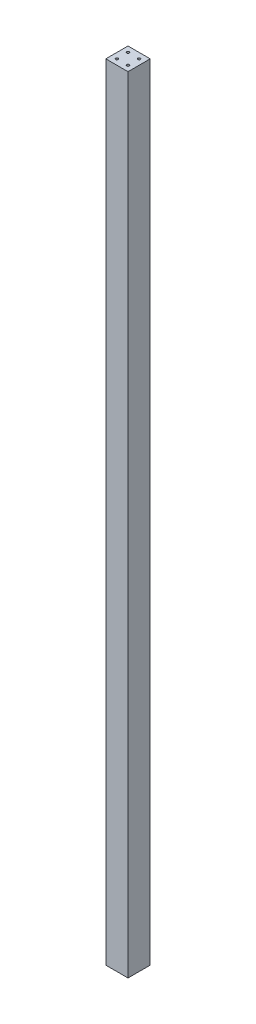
ISO-10303-21;
HEADER;
FILE_DESCRIPTION(('STEP AP214'),'2;1');
FILE_NAME('part.step','',(''),(''),'','','');
FILE_SCHEMA(('AUTOMOTIVE_DESIGN { 1 0 10303 214 1 1 1 1 }'));
ENDSEC;
DATA;
#1=APPLICATION_CONTEXT('core data for automotive mechanical design processes');
#2=APPLICATION_PROTOCOL_DEFINITION('international standard','automotive_design',2000,#1);
#3=PRODUCT_CONTEXT('',#1,'mechanical');
#4=PRODUCT('Part','Part','',(#3));
#5=PRODUCT_RELATED_PRODUCT_CATEGORY('part','',(#4));
#6=PRODUCT_DEFINITION_FORMATION('','',#4);
#7=PRODUCT_DEFINITION_CONTEXT('part definition',#1,'design');
#8=PRODUCT_DEFINITION('design','',#6,#7);
#9=PRODUCT_DEFINITION_SHAPE('','',#8);
#10=(LENGTH_UNIT() NAMED_UNIT(*) SI_UNIT(.MILLI.,.METRE.));
#11=(NAMED_UNIT(*) PLANE_ANGLE_UNIT() SI_UNIT($,.RADIAN.));
#12=(NAMED_UNIT(*) SI_UNIT($,.STERADIAN.) SOLID_ANGLE_UNIT());
#13=UNCERTAINTY_MEASURE_WITH_UNIT(LENGTH_MEASURE(1.E-05),#10,'distance_accuracy_value','');
#14=(GEOMETRIC_REPRESENTATION_CONTEXT(3) GLOBAL_UNCERTAINTY_ASSIGNED_CONTEXT((#13)) GLOBAL_UNIT_ASSIGNED_CONTEXT((#10,
#11,#12)) REPRESENTATION_CONTEXT('',''));
#15=CARTESIAN_POINT('',(0.,0.,0.));
#16=DIRECTION('',(0.,0.,1.));
#17=DIRECTION('',(1.,0.,0.));
#18=AXIS2_PLACEMENT_3D('',#15,#16,#17);
#19=CARTESIAN_POINT('',(-15.,2120.,15.));
#20=DIRECTION('',(0.,1.,0.));
#21=DIRECTION('',(0.,0.,1.));
#22=AXIS2_PLACEMENT_3D('',#19,#20,#21);
#23=CYLINDRICAL_SURFACE('',#22,3.39999999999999);
#24=CARTESIAN_POINT('',(-15.,2102.29292610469,15.));
#25=DIRECTION('',(0.,1.,0.));
#26=DIRECTION('',(0.,0.,1.));
#27=AXIS2_PLACEMENT_3D('',#24,#25,#26);
#28=CIRCLE('',#27,3.4);
#29=CARTESIAN_POINT('',(-15.,2102.29292610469,18.4));
#30=VERTEX_POINT('',#29);
#31=EDGE_CURVE('E11',#30,#30,#28,.T.);
#32=ORIENTED_EDGE('',*,*,#31,.F.);
#33=EDGE_LOOP('',(#32));
#34=FACE_BOUND('',#33,.T.);
#35=CARTESIAN_POINT('',(-15.,2120.,15.));
#36=DIRECTION('',(0.,1.,0.));
#37=DIRECTION('',(0.,0.,1.));
#38=AXIS2_PLACEMENT_3D('',#35,#36,#37);
#39=CIRCLE('',#38,3.39999999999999);
#40=CARTESIAN_POINT('',(-15.,2120.,18.4));
#41=VERTEX_POINT('',#40);
#42=EDGE_CURVE('E61',#41,#41,#39,.T.);
#43=ORIENTED_EDGE('',*,*,#42,.T.);
#44=EDGE_LOOP('',(#43));
#45=FACE_BOUND('',#44,.T.);
#46=ADVANCED_FACE('F53',(#34,#45),#23,.F.);
#47=CARTESIAN_POINT('',(-15.,2102.29292610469,15.));
#48=DIRECTION('',(0.,1.,0.));
#49=DIRECTION('',(0.,0.,1.));
#50=AXIS2_PLACEMENT_3D('',#47,#48,#49);
#51=CONICAL_SURFACE('',#50,3.4,1.02974425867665);
#52=CARTESIAN_POINT('',(-15.,2100.25,15.));
#53=VERTEX_POINT('',#52);
#54=VERTEX_LOOP('',#53);
#55=FACE_BOUND('',#54,.T.);
#56=ORIENTED_EDGE('',*,*,#31,.T.);
#57=EDGE_LOOP('',(#56));
#58=FACE_BOUND('',#57,.T.);
#59=ADVANCED_FACE('F242',(#55,#58),#51,.F.);
#60=CARTESIAN_POINT('',(15.,2120.,15.));
#61=DIRECTION('',(0.,1.,0.));
#62=DIRECTION('',(0.,0.,1.));
#63=AXIS2_PLACEMENT_3D('',#60,#61,#62);
#64=CYLINDRICAL_SURFACE('',#63,3.39999999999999);
#65=CARTESIAN_POINT('',(15.,2102.29292610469,15.));
#66=DIRECTION('',(0.,1.,0.));
#67=DIRECTION('',(0.,0.,1.));
#68=AXIS2_PLACEMENT_3D('',#65,#66,#67);
#69=CIRCLE('',#68,3.4);
#70=CARTESIAN_POINT('',(15.,2102.29292610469,18.4));
#71=VERTEX_POINT('',#70);
#72=EDGE_CURVE('E213',#71,#71,#69,.T.);
#73=ORIENTED_EDGE('',*,*,#72,.F.);
#74=EDGE_LOOP('',(#73));
#75=FACE_BOUND('',#74,.T.);
#76=CARTESIAN_POINT('',(15.,2120.,15.));
#77=DIRECTION('',(0.,1.,0.));
#78=DIRECTION('',(0.,0.,1.));
#79=AXIS2_PLACEMENT_3D('',#76,#77,#78);
#80=CIRCLE('',#79,3.39999999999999);
#81=CARTESIAN_POINT('',(15.,2120.,18.4));
#82=VERTEX_POINT('',#81);
#83=EDGE_CURVE('E209',#82,#82,#80,.T.);
#84=ORIENTED_EDGE('',*,*,#83,.T.);
#85=EDGE_LOOP('',(#84));
#86=FACE_BOUND('',#85,.T.);
#87=ADVANCED_FACE('F248',(#75,#86),#64,.F.);
#88=CARTESIAN_POINT('',(15.,2102.29292610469,15.));
#89=DIRECTION('',(0.,1.,0.));
#90=DIRECTION('',(0.,0.,1.));
#91=AXIS2_PLACEMENT_3D('',#88,#89,#90);
#92=CONICAL_SURFACE('',#91,3.4,1.02974425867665);
#93=CARTESIAN_POINT('',(15.,2100.25,15.));
#94=VERTEX_POINT('',#93);
#95=VERTEX_LOOP('',#94);
#96=FACE_BOUND('',#95,.T.);
#97=ORIENTED_EDGE('',*,*,#72,.T.);
#98=EDGE_LOOP('',(#97));
#99=FACE_BOUND('',#98,.T.);
#100=ADVANCED_FACE('F255',(#96,#99),#92,.F.);
#101=CARTESIAN_POINT('',(-15.,0.,15.));
#102=DIRECTION('',(0.,-1.,0.));
#103=DIRECTION('',(0.,0.,-1.));
#104=AXIS2_PLACEMENT_3D('',#101,#102,#103);
#105=CYLINDRICAL_SURFACE('',#104,3.39999999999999);
#106=CARTESIAN_POINT('',(-15.,17.7070738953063,15.));
#107=DIRECTION('',(0.,-1.,0.));
#108=DIRECTION('',(0.,0.,-1.));
#109=AXIS2_PLACEMENT_3D('',#106,#107,#108);
#110=CIRCLE('',#109,3.4);
#111=CARTESIAN_POINT('',(-15.,17.7070738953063,11.6));
#112=VERTEX_POINT('',#111);
#113=EDGE_CURVE('E205',#112,#112,#110,.T.);
#114=ORIENTED_EDGE('',*,*,#113,.F.);
#115=EDGE_LOOP('',(#114));
#116=FACE_BOUND('',#115,.T.);
#117=CARTESIAN_POINT('',(-15.,0.,15.));
#118=DIRECTION('',(0.,-1.,0.));
#119=DIRECTION('',(0.,0.,-1.));
#120=AXIS2_PLACEMENT_3D('',#117,#118,#119);
#121=CIRCLE('',#120,3.39999999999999);
#122=CARTESIAN_POINT('',(-15.,0.,11.6));
#123=VERTEX_POINT('',#122);
#124=EDGE_CURVE('E201',#123,#123,#121,.T.);
#125=ORIENTED_EDGE('',*,*,#124,.T.);
#126=EDGE_LOOP('',(#125));
#127=FACE_BOUND('',#126,.T.);
#128=ADVANCED_FACE('F260',(#116,#127),#105,.F.);
#129=CARTESIAN_POINT('',(-15.,17.7070738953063,15.));
#130=DIRECTION('',(0.,-1.,0.));
#131=DIRECTION('',(0.,0.,-1.));
#132=AXIS2_PLACEMENT_3D('',#129,#130,#131);
#133=CONICAL_SURFACE('',#132,3.4,1.02974425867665);
#134=CARTESIAN_POINT('',(-15.,19.75,15.));
#135=VERTEX_POINT('',#134);
#136=VERTEX_LOOP('',#135);
#137=FACE_BOUND('',#136,.T.);
#138=ORIENTED_EDGE('',*,*,#113,.T.);
#139=EDGE_LOOP('',(#138));
#140=FACE_BOUND('',#139,.T.);
#141=ADVANCED_FACE('F263',(#137,#140),#133,.F.);
#142=CARTESIAN_POINT('',(15.,0.,15.));
#143=DIRECTION('',(0.,-1.,0.));
#144=DIRECTION('',(0.,0.,-1.));
#145=AXIS2_PLACEMENT_3D('',#142,#143,#144);
#146=CYLINDRICAL_SURFACE('',#145,3.39999999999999);
#147=CARTESIAN_POINT('',(15.,17.7070738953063,15.));
#148=DIRECTION('',(0.,-1.,0.));
#149=DIRECTION('',(0.,0.,-1.));
#150=AXIS2_PLACEMENT_3D('',#147,#148,#149);
#151=CIRCLE('',#150,3.4);
#152=CARTESIAN_POINT('',(15.,17.7070738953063,11.6));
#153=VERTEX_POINT('',#152);
#154=EDGE_CURVE('E197',#153,#153,#151,.T.);
#155=ORIENTED_EDGE('',*,*,#154,.F.);
#156=EDGE_LOOP('',(#155));
#157=FACE_BOUND('',#156,.T.);
#158=CARTESIAN_POINT('',(15.,0.,15.));
#159=DIRECTION('',(0.,-1.,0.));
#160=DIRECTION('',(0.,0.,-1.));
#161=AXIS2_PLACEMENT_3D('',#158,#159,#160);
#162=CIRCLE('',#161,3.39999999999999);
#163=CARTESIAN_POINT('',(15.,0.,11.6));
#164=VERTEX_POINT('',#163);
#165=EDGE_CURVE('E193',#164,#164,#162,.T.);
#166=ORIENTED_EDGE('',*,*,#165,.T.);
#167=EDGE_LOOP('',(#166));
#168=FACE_BOUND('',#167,.T.);
#169=ADVANCED_FACE('F267',(#157,#168),#146,.F.);
#170=CARTESIAN_POINT('',(15.,17.7070738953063,15.));
#171=DIRECTION('',(0.,-1.,0.));
#172=DIRECTION('',(0.,0.,-1.));
#173=AXIS2_PLACEMENT_3D('',#170,#171,#172);
#174=CONICAL_SURFACE('',#173,3.4,1.02974425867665);
#175=CARTESIAN_POINT('',(15.,19.75,15.));
#176=VERTEX_POINT('',#175);
#177=VERTEX_LOOP('',#176);
#178=FACE_BOUND('',#177,.T.);
#179=ORIENTED_EDGE('',*,*,#154,.T.);
#180=EDGE_LOOP('',(#179));
#181=FACE_BOUND('',#180,.T.);
#182=ADVANCED_FACE('F271',(#178,#181),#174,.F.);
#183=CARTESIAN_POINT('',(30.,2120.,-30.));
#184=DIRECTION('',(-1.,0.,0.));
#185=DIRECTION('',(0.,0.,1.));
#186=AXIS2_PLACEMENT_3D('',#183,#184,#185);
#187=PLANE('',#186);
#188=DIRECTION('',(0.,0.,-1.));
#189=VECTOR('',#188,1.);
#190=CARTESIAN_POINT('',(30.,0.,-30.));
#191=LINE('',#190,#189);
#192=CARTESIAN_POINT('',(30.,0.,30.));
#193=VERTEX_POINT('',#192);
#194=CARTESIAN_POINT('',(30.,0.,-30.));
#195=VERTEX_POINT('',#194);
#196=EDGE_CURVE('E151',#193,#195,#191,.T.);
#197=ORIENTED_EDGE('',*,*,#196,.T.);
#198=DIRECTION('',(0.,-1.,0.));
#199=VECTOR('',#198,1.);
#200=CARTESIAN_POINT('',(30.,2120.,-30.));
#201=LINE('',#200,#199);
#202=CARTESIAN_POINT('',(30.,2120.,-30.));
#203=VERTEX_POINT('',#202);
#204=EDGE_CURVE('E189',#203,#195,#201,.T.);
#205=ORIENTED_EDGE('',*,*,#204,.F.);
#206=DIRECTION('',(0.,0.,-1.));
#207=VECTOR('',#206,1.);
#208=CARTESIAN_POINT('',(30.,2120.,-30.));
#209=LINE('',#208,#207);
#210=CARTESIAN_POINT('',(30.,2120.,30.));
#211=VERTEX_POINT('',#210);
#212=EDGE_CURVE('E152',#211,#203,#209,.T.);
#213=ORIENTED_EDGE('',*,*,#212,.F.);
#214=DIRECTION('',(0.,-1.,0.));
#215=VECTOR('',#214,1.);
#216=CARTESIAN_POINT('',(30.,2120.,30.));
#217=LINE('',#216,#215);
#218=EDGE_CURVE('E166',#211,#193,#217,.T.);
#219=ORIENTED_EDGE('',*,*,#218,.T.);
#220=EDGE_LOOP('',(#197,#205,#213,#219));
#221=FACE_BOUND('',#220,.T.);
#222=ADVANCED_FACE('F275',(#221),#187,.F.);
#223=CARTESIAN_POINT('',(-30.,2120.,-30.));
#224=DIRECTION('',(0.,0.,1.));
#225=DIRECTION('',(1.,0.,0.));
#226=AXIS2_PLACEMENT_3D('',#223,#224,#225);
#227=PLANE('',#226);
#228=DIRECTION('',(-1.,0.,0.));
#229=VECTOR('',#228,1.);
#230=CARTESIAN_POINT('',(-30.,0.,-30.));
#231=LINE('',#230,#229);
#232=CARTESIAN_POINT('',(-30.,0.,-30.));
#233=VERTEX_POINT('',#232);
#234=EDGE_CURVE('E170',#195,#233,#231,.T.);
#235=ORIENTED_EDGE('',*,*,#234,.T.);
#236=DIRECTION('',(0.,-1.,0.));
#237=VECTOR('',#236,1.);
#238=CARTESIAN_POINT('',(-30.,2120.,-30.));
#239=LINE('',#238,#237);
#240=CARTESIAN_POINT('',(-30.,2120.,-30.));
#241=VERTEX_POINT('',#240);
#242=EDGE_CURVE('E185',#241,#233,#239,.T.);
#243=ORIENTED_EDGE('',*,*,#242,.F.);
#244=DIRECTION('',(-1.,0.,0.));
#245=VECTOR('',#244,1.);
#246=CARTESIAN_POINT('',(-30.,2120.,-30.));
#247=LINE('',#246,#245);
#248=EDGE_CURVE('E156',#203,#241,#247,.T.);
#249=ORIENTED_EDGE('',*,*,#248,.F.);
#250=ORIENTED_EDGE('',*,*,#204,.T.);
#251=EDGE_LOOP('',(#235,#243,#249,#250));
#252=FACE_BOUND('',#251,.T.);
#253=ADVANCED_FACE('F279',(#252),#227,.F.);
#254=CARTESIAN_POINT('',(-30.,2120.,-30.));
#255=DIRECTION('',(1.,0.,0.));
#256=DIRECTION('',(0.,0.,-1.));
#257=AXIS2_PLACEMENT_3D('',#254,#255,#256);
#258=PLANE('',#257);
#259=DIRECTION('',(0.,0.,1.));
#260=VECTOR('',#259,1.);
#261=CARTESIAN_POINT('',(-30.,0.,-30.));
#262=LINE('',#261,#260);
#263=CARTESIAN_POINT('',(-30.,0.,30.));
#264=VERTEX_POINT('',#263);
#265=EDGE_CURVE('E173',#233,#264,#262,.T.);
#266=ORIENTED_EDGE('',*,*,#265,.T.);
#267=DIRECTION('',(0.,-1.,0.));
#268=VECTOR('',#267,1.);
#269=CARTESIAN_POINT('',(-30.,2120.,30.));
#270=LINE('',#269,#268);
#271=CARTESIAN_POINT('',(-30.,2120.,30.));
#272=VERTEX_POINT('',#271);
#273=EDGE_CURVE('E181',#272,#264,#270,.T.);
#274=ORIENTED_EDGE('',*,*,#273,.F.);
#275=DIRECTION('',(0.,0.,1.));
#276=VECTOR('',#275,1.);
#277=CARTESIAN_POINT('',(-30.,2120.,-30.));
#278=LINE('',#277,#276);
#279=EDGE_CURVE('E160',#241,#272,#278,.T.);
#280=ORIENTED_EDGE('',*,*,#279,.F.);
#281=ORIENTED_EDGE('',*,*,#242,.T.);
#282=EDGE_LOOP('',(#266,#274,#280,#281));
#283=FACE_BOUND('',#282,.T.);
#284=ADVANCED_FACE('F235',(#283),#258,.F.);
#285=CARTESIAN_POINT('',(-30.,2120.,30.));
#286=DIRECTION('',(0.,0.,-1.));
#287=DIRECTION('',(-1.,0.,0.));
#288=AXIS2_PLACEMENT_3D('',#285,#286,#287);
#289=PLANE('',#288);
#290=DIRECTION('',(1.,0.,0.));
#291=VECTOR('',#290,1.);
#292=CARTESIAN_POINT('',(-30.,0.,30.));
#293=LINE('',#292,#291);
#294=EDGE_CURVE('E157',#264,#193,#293,.T.);
#295=ORIENTED_EDGE('',*,*,#294,.T.);
#296=ORIENTED_EDGE('',*,*,#218,.F.);
#297=DIRECTION('',(1.,0.,0.));
#298=VECTOR('',#297,1.);
#299=CARTESIAN_POINT('',(-30.,2120.,30.));
#300=LINE('',#299,#298);
#301=EDGE_CURVE('E163',#272,#211,#300,.T.);
#302=ORIENTED_EDGE('',*,*,#301,.F.);
#303=ORIENTED_EDGE('',*,*,#273,.T.);
#304=EDGE_LOOP('',(#295,#296,#302,#303));
#305=FACE_BOUND('',#304,.T.);
#306=ADVANCED_FACE('F224',(#305),#289,.F.);
#307=CARTESIAN_POINT('',(0.,2120.,0.));
#308=DIRECTION('',(0.,1.,0.));
#309=DIRECTION('',(0.,0.,1.));
#310=AXIS2_PLACEMENT_3D('',#307,#308,#309);
#311=PLANE('',#310);
#312=CARTESIAN_POINT('',(-15.,2120.,-15.));
#313=DIRECTION('',(0.,1.,0.));
#314=DIRECTION('',(0.,0.,1.));
#315=AXIS2_PLACEMENT_3D('',#312,#313,#314);
#316=CIRCLE('',#315,3.39999999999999);
#317=CARTESIAN_POINT('',(-15.,2120.,-11.6));
#318=VERTEX_POINT('',#317);
#319=EDGE_CURVE('E122',#318,#318,#316,.T.);
#320=ORIENTED_EDGE('',*,*,#319,.F.);
#321=EDGE_LOOP('',(#320));
#322=FACE_BOUND('',#321,.T.);
#323=CARTESIAN_POINT('',(15.,2120.,-15.));
#324=DIRECTION('',(0.,1.,0.));
#325=DIRECTION('',(0.,0.,1.));
#326=AXIS2_PLACEMENT_3D('',#323,#324,#325);
#327=CIRCLE('',#326,3.39999999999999);
#328=CARTESIAN_POINT('',(15.,2120.,-11.6));
#329=VERTEX_POINT('',#328);
#330=EDGE_CURVE('E121',#329,#329,#327,.T.);
#331=ORIENTED_EDGE('',*,*,#330,.F.);
#332=EDGE_LOOP('',(#331));
#333=FACE_BOUND('',#332,.T.);
#334=ORIENTED_EDGE('',*,*,#212,.T.);
#335=ORIENTED_EDGE('',*,*,#248,.T.);
#336=ORIENTED_EDGE('',*,*,#279,.T.);
#337=ORIENTED_EDGE('',*,*,#301,.T.);
#338=EDGE_LOOP('',(#334,#335,#336,#337));
#339=FACE_BOUND('',#338,.T.);
#340=ORIENTED_EDGE('',*,*,#83,.F.);
#341=EDGE_LOOP('',(#340));
#342=FACE_BOUND('',#341,.T.);
#343=ORIENTED_EDGE('',*,*,#42,.F.);
#344=EDGE_LOOP('',(#343));
#345=FACE_BOUND('',#344,.T.);
#346=ADVANCED_FACE('F221',(#322,#333,#339,#342,#345),#311,.T.);
#347=CARTESIAN_POINT('',(0.,0.,0.));
#348=DIRECTION('',(0.,1.,0.));
#349=DIRECTION('',(0.,0.,1.));
#350=AXIS2_PLACEMENT_3D('',#347,#348,#349);
#351=PLANE('',#350);
#352=CARTESIAN_POINT('',(-15.,0.,-15.));
#353=DIRECTION('',(0.,-1.,0.));
#354=DIRECTION('',(0.,0.,-1.));
#355=AXIS2_PLACEMENT_3D('',#352,#353,#354);
#356=CIRCLE('',#355,3.39999999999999);
#357=CARTESIAN_POINT('',(-15.,0.,-18.4));
#358=VERTEX_POINT('',#357);
#359=EDGE_CURVE('E135',#358,#358,#356,.T.);
#360=ORIENTED_EDGE('',*,*,#359,.F.);
#361=EDGE_LOOP('',(#360));
#362=FACE_BOUND('',#361,.T.);
#363=CARTESIAN_POINT('',(15.,0.,-15.));
#364=DIRECTION('',(0.,-1.,0.));
#365=DIRECTION('',(0.,0.,-1.));
#366=AXIS2_PLACEMENT_3D('',#363,#364,#365);
#367=CIRCLE('',#366,3.39999999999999);
#368=CARTESIAN_POINT('',(15.,0.,-18.4));
#369=VERTEX_POINT('',#368);
#370=EDGE_CURVE('E143',#369,#369,#367,.T.);
#371=ORIENTED_EDGE('',*,*,#370,.F.);
#372=EDGE_LOOP('',(#371));
#373=FACE_BOUND('',#372,.T.);
#374=ORIENTED_EDGE('',*,*,#196,.F.);
#375=ORIENTED_EDGE('',*,*,#294,.F.);
#376=ORIENTED_EDGE('',*,*,#265,.F.);
#377=ORIENTED_EDGE('',*,*,#234,.F.);
#378=EDGE_LOOP('',(#374,#375,#376,#377));
#379=FACE_BOUND('',#378,.T.);
#380=ORIENTED_EDGE('',*,*,#165,.F.);
#381=EDGE_LOOP('',(#380));
#382=FACE_BOUND('',#381,.T.);
#383=ORIENTED_EDGE('',*,*,#124,.F.);
#384=EDGE_LOOP('',(#383));
#385=FACE_BOUND('',#384,.T.);
#386=ADVANCED_FACE('F223',(#362,#373,#379,#382,#385),#351,.F.);
#387=CARTESIAN_POINT('',(15.,17.7070738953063,-15.));
#388=DIRECTION('',(0.,-1.,0.));
#389=DIRECTION('',(0.,0.,-1.));
#390=AXIS2_PLACEMENT_3D('',#387,#388,#389);
#391=CONICAL_SURFACE('',#390,3.4,1.02974425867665);
#392=CARTESIAN_POINT('',(15.,19.75,-15.));
#393=VERTEX_POINT('',#392);
#394=VERTEX_LOOP('',#393);
#395=FACE_BOUND('',#394,.T.);
#396=CARTESIAN_POINT('',(15.,17.7070738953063,-15.));
#397=DIRECTION('',(0.,-1.,0.));
#398=DIRECTION('',(0.,0.,-1.));
#399=AXIS2_PLACEMENT_3D('',#396,#397,#398);
#400=CIRCLE('',#399,3.4);
#401=CARTESIAN_POINT('',(15.,17.7070738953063,-18.4));
#402=VERTEX_POINT('',#401);
#403=EDGE_CURVE('E147',#402,#402,#400,.T.);
#404=ORIENTED_EDGE('',*,*,#403,.T.);
#405=EDGE_LOOP('',(#404));
#406=FACE_BOUND('',#405,.T.);
#407=ADVANCED_FACE('F231',(#395,#406),#391,.F.);
#408=CARTESIAN_POINT('',(15.,0.,-15.));
#409=DIRECTION('',(0.,-1.,0.));
#410=DIRECTION('',(0.,0.,-1.));
#411=AXIS2_PLACEMENT_3D('',#408,#409,#410);
#412=CYLINDRICAL_SURFACE('',#411,3.39999999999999);
#413=ORIENTED_EDGE('',*,*,#403,.F.);
#414=EDGE_LOOP('',(#413));
#415=FACE_BOUND('',#414,.T.);
#416=ORIENTED_EDGE('',*,*,#370,.T.);
#417=EDGE_LOOP('',(#416));
#418=FACE_BOUND('',#417,.T.);
#419=ADVANCED_FACE('F323',(#415,#418),#412,.F.);
#420=CARTESIAN_POINT('',(-15.,17.7070738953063,-15.));
#421=DIRECTION('',(0.,-1.,0.));
#422=DIRECTION('',(0.,0.,-1.));
#423=AXIS2_PLACEMENT_3D('',#420,#421,#422);
#424=CONICAL_SURFACE('',#423,3.4,1.02974425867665);
#425=CARTESIAN_POINT('',(-15.,19.75,-15.));
#426=VERTEX_POINT('',#425);
#427=VERTEX_LOOP('',#426);
#428=FACE_BOUND('',#427,.T.);
#429=CARTESIAN_POINT('',(-15.,17.7070738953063,-15.));
#430=DIRECTION('',(0.,-1.,0.));
#431=DIRECTION('',(0.,0.,-1.));
#432=AXIS2_PLACEMENT_3D('',#429,#430,#431);
#433=CIRCLE('',#432,3.4);
#434=CARTESIAN_POINT('',(-15.,17.7070738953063,-18.4));
#435=VERTEX_POINT('',#434);
#436=EDGE_CURVE('E139',#435,#435,#433,.T.);
#437=ORIENTED_EDGE('',*,*,#436,.T.);
#438=EDGE_LOOP('',(#437));
#439=FACE_BOUND('',#438,.T.);
#440=ADVANCED_FACE('F334',(#428,#439),#424,.F.);
#441=CARTESIAN_POINT('',(-15.,0.,-15.));
#442=DIRECTION('',(0.,-1.,0.));
#443=DIRECTION('',(0.,0.,-1.));
#444=AXIS2_PLACEMENT_3D('',#441,#442,#443);
#445=CYLINDRICAL_SURFACE('',#444,3.39999999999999);
#446=ORIENTED_EDGE('',*,*,#436,.F.);
#447=EDGE_LOOP('',(#446));
#448=FACE_BOUND('',#447,.T.);
#449=ORIENTED_EDGE('',*,*,#359,.T.);
#450=EDGE_LOOP('',(#449));
#451=FACE_BOUND('',#450,.T.);
#452=ADVANCED_FACE('F380',(#448,#451),#445,.F.);
#453=CARTESIAN_POINT('',(15.,2102.29292610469,-15.));
#454=DIRECTION('',(0.,1.,0.));
#455=DIRECTION('',(0.,0.,1.));
#456=AXIS2_PLACEMENT_3D('',#453,#454,#455);
#457=CONICAL_SURFACE('',#456,3.4,1.02974425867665);
#458=CARTESIAN_POINT('',(15.,2100.25,-15.));
#459=VERTEX_POINT('',#458);
#460=VERTEX_LOOP('',#459);
#461=FACE_BOUND('',#460,.T.);
#462=CARTESIAN_POINT('',(15.,2102.29292610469,-15.));
#463=DIRECTION('',(0.,1.,0.));
#464=DIRECTION('',(0.,0.,1.));
#465=AXIS2_PLACEMENT_3D('',#462,#463,#464);
#466=CIRCLE('',#465,3.4);
#467=CARTESIAN_POINT('',(15.,2102.29292610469,-11.6));
#468=VERTEX_POINT('',#467);
#469=EDGE_CURVE('E127',#468,#468,#466,.T.);
#470=ORIENTED_EDGE('',*,*,#469,.T.);
#471=EDGE_LOOP('',(#470));
#472=FACE_BOUND('',#471,.T.);
#473=ADVANCED_FACE('F390',(#461,#472),#457,.F.);
#474=CARTESIAN_POINT('',(15.,2120.,-15.));
#475=DIRECTION('',(0.,1.,0.));
#476=DIRECTION('',(0.,0.,1.));
#477=AXIS2_PLACEMENT_3D('',#474,#475,#476);
#478=CYLINDRICAL_SURFACE('',#477,3.39999999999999);
#479=ORIENTED_EDGE('',*,*,#469,.F.);
#480=EDGE_LOOP('',(#479));
#481=FACE_BOUND('',#480,.T.);
#482=ORIENTED_EDGE('',*,*,#330,.T.);
#483=EDGE_LOOP('',(#482));
#484=FACE_BOUND('',#483,.T.);
#485=ADVANCED_FACE('F114',(#481,#484),#478,.F.);
#486=CARTESIAN_POINT('',(-15.,2102.29292610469,-15.));
#487=DIRECTION('',(0.,1.,0.));
#488=DIRECTION('',(0.,0.,1.));
#489=AXIS2_PLACEMENT_3D('',#486,#487,#488);
#490=CONICAL_SURFACE('',#489,3.4,1.02974425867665);
#491=CARTESIAN_POINT('',(-15.,2100.25,-15.));
#492=VERTEX_POINT('',#491);
#493=VERTEX_LOOP('',#492);
#494=FACE_BOUND('',#493,.T.);
#495=CARTESIAN_POINT('',(-15.,2102.29292610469,-15.));
#496=DIRECTION('',(0.,1.,0.));
#497=DIRECTION('',(0.,0.,1.));
#498=AXIS2_PLACEMENT_3D('',#495,#496,#497);
#499=CIRCLE('',#498,3.4);
#500=CARTESIAN_POINT('',(-15.,2102.29292610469,-11.6));
#501=VERTEX_POINT('',#500);
#502=EDGE_CURVE('E118',#501,#501,#499,.T.);
#503=ORIENTED_EDGE('',*,*,#502,.T.);
#504=EDGE_LOOP('',(#503));
#505=FACE_BOUND('',#504,.T.);
#506=ADVANCED_FACE('F110',(#494,#505),#490,.F.);
#507=CARTESIAN_POINT('',(-15.,2120.,-15.));
#508=DIRECTION('',(0.,1.,0.));
#509=DIRECTION('',(0.,0.,1.));
#510=AXIS2_PLACEMENT_3D('',#507,#508,#509);
#511=CYLINDRICAL_SURFACE('',#510,3.39999999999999);
#512=ORIENTED_EDGE('',*,*,#502,.F.);
#513=EDGE_LOOP('',(#512));
#514=FACE_BOUND('',#513,.T.);
#515=ORIENTED_EDGE('',*,*,#319,.T.);
#516=EDGE_LOOP('',(#515));
#517=FACE_BOUND('',#516,.T.);
#518=ADVANCED_FACE('F113',(#514,#517),#511,.F.);
#519=CLOSED_SHELL('',(#46,#59,#87,#100,#128,#141,#169,#182,#222,#253,#284,#306,#346,#386,#407,
#419,#440,#452,#473,#485,#506,#518));
#520=MANIFOLD_SOLID_BREP('B2',#519);
#521=ADVANCED_BREP_SHAPE_REPRESENTATION('',(#18,#520),#14);
#522=SHAPE_DEFINITION_REPRESENTATION(#9,#521);
ENDSEC;
END-ISO-10303-21;
